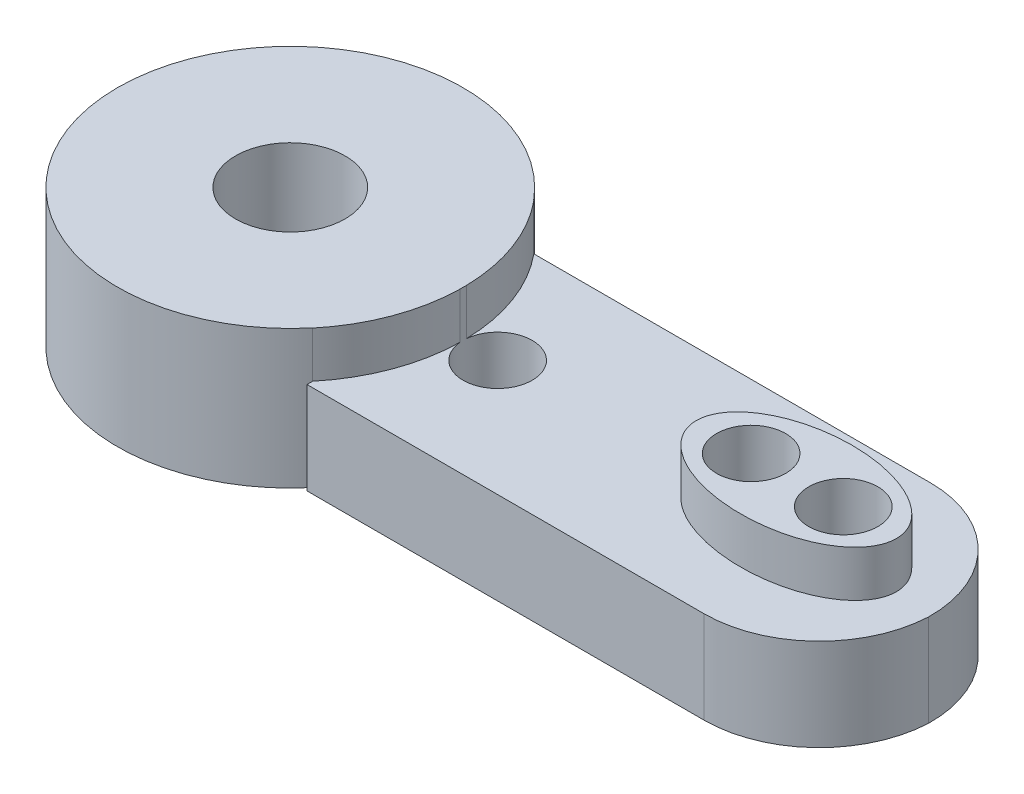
ISO-10303-21;
HEADER;
FILE_DESCRIPTION(('STEP AP214'),'2;1');
FILE_NAME('part.step','',(''),(''),'','','');
FILE_SCHEMA(('AUTOMOTIVE_DESIGN { 1 0 10303 214 1 1 1 1 }'));
ENDSEC;
DATA;
#1=APPLICATION_CONTEXT('core data for automotive mechanical design processes');
#2=APPLICATION_PROTOCOL_DEFINITION('international standard','automotive_design',2000,#1);
#3=PRODUCT_CONTEXT('',#1,'mechanical');
#4=PRODUCT('Part','Part','',(#3));
#5=PRODUCT_RELATED_PRODUCT_CATEGORY('part','',(#4));
#6=PRODUCT_DEFINITION_FORMATION('','',#4);
#7=PRODUCT_DEFINITION_CONTEXT('part definition',#1,'design');
#8=PRODUCT_DEFINITION('design','',#6,#7);
#9=PRODUCT_DEFINITION_SHAPE('','',#8);
#10=(LENGTH_UNIT() NAMED_UNIT(*) SI_UNIT(.MILLI.,.METRE.));
#11=(NAMED_UNIT(*) PLANE_ANGLE_UNIT() SI_UNIT($,.RADIAN.));
#12=(NAMED_UNIT(*) SI_UNIT($,.STERADIAN.) SOLID_ANGLE_UNIT());
#13=UNCERTAINTY_MEASURE_WITH_UNIT(LENGTH_MEASURE(1.E-05),#10,'distance_accuracy_value','');
#14=(GEOMETRIC_REPRESENTATION_CONTEXT(3) GLOBAL_UNCERTAINTY_ASSIGNED_CONTEXT((#13)) GLOBAL_UNIT_ASSIGNED_CONTEXT((#10,
#11,#12)) REPRESENTATION_CONTEXT('',''));
#15=CARTESIAN_POINT('',(0.,0.,0.));
#16=DIRECTION('',(0.,0.,1.));
#17=DIRECTION('',(1.,0.,0.));
#18=AXIS2_PLACEMENT_3D('',#15,#16,#17);
#19=CARTESIAN_POINT('',(-12.0179381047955,6.,-0.605555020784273));
#20=DIRECTION('',(0.,1.,0.));
#21=DIRECTION('',(0.,0.,1.));
#22=AXIS2_PLACEMENT_3D('',#19,#20,#21);
#23=PLANE('',#22);
#24=CARTESIAN_POINT('',(-12.0179381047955,6.,-0.605555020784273));
#25=DIRECTION('',(0.,1.,0.));
#26=DIRECTION('',(0.,0.,1.));
#27=AXIS2_PLACEMENT_3D('',#24,#25,#26);
#28=CIRCLE('',#27,2.37554244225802);
#29=CARTESIAN_POINT('',(-12.0179381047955,6.,1.76998742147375));
#30=VERTEX_POINT('',#29);
#31=EDGE_CURVE('E149',#30,#30,#28,.T.);
#32=ORIENTED_EDGE('',*,*,#31,.F.);
#33=EDGE_LOOP('',(#32));
#34=FACE_BOUND('',#33,.T.);
#35=DIRECTION('',(0.,0.,1.));
#36=VECTOR('',#35,1.);
#37=CARTESIAN_POINT('',(-6.24526724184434,6.,4.18258356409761));
#38=LINE('',#37,#36);
#39=CARTESIAN_POINT('',(-6.24526724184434,6.,4.18258356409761));
#40=VERTEX_POINT('',#39);
#41=CARTESIAN_POINT('',(-6.24526724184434,6.,4.19456089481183));
#42=VERTEX_POINT('',#41);
#43=EDGE_CURVE('E128',#40,#42,#38,.T.);
#44=ORIENTED_EDGE('',*,*,#43,.T.);
#45=CARTESIAN_POINT('',(-12.0179381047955,6.,-0.605555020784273));
#46=DIRECTION('',(0.,1.,0.));
#47=DIRECTION('',(0.,0.,1.));
#48=AXIS2_PLACEMENT_3D('',#45,#46,#47);
#49=CIRCLE('',#48,7.50765220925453);
#50=CARTESIAN_POINT('',(-4.51155801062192,6.,-0.467353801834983));
#51=VERTEX_POINT('',#50);
#52=EDGE_CURVE('E110',#42,#51,#49,.T.);
#53=ORIENTED_EDGE('',*,*,#52,.T.);
#54=CARTESIAN_POINT('',(-3.0179381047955,6.,-0.605555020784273));
#55=DIRECTION('',(0.,1.,0.));
#56=DIRECTION('',(0.,0.,1.));
#57=AXIS2_PLACEMENT_3D('',#54,#55,#56);
#58=CIRCLE('',#57,1.5);
#59=CARTESIAN_POINT('',(-4.51155801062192,6.,-0.743756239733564));
#60=VERTEX_POINT('',#59);
#61=EDGE_CURVE('E178',#60,#51,#58,.T.);
#62=ORIENTED_EDGE('',*,*,#61,.F.);
#63=CARTESIAN_POINT('',(-6.23532878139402,6.,-5.39369360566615));
#64=VERTEX_POINT('',#63);
#65=EDGE_CURVE('E122',#60,#64,#49,.T.);
#66=ORIENTED_EDGE('',*,*,#65,.T.);
#67=DIRECTION('',(-1.,0.,0.));
#68=VECTOR('',#67,1.);
#69=CARTESIAN_POINT('',(-6.24526724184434,6.,-5.39369360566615));
#70=LINE('',#69,#68);
#71=CARTESIAN_POINT('',(-6.24526724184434,6.,-5.39369360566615));
#72=VERTEX_POINT('',#71);
#73=EDGE_CURVE('E137',#64,#72,#70,.T.);
#74=ORIENTED_EDGE('',*,*,#73,.T.);
#75=CARTESIAN_POINT('',(-12.0179381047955,6.,-0.605555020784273));
#76=DIRECTION('',(0.,1.,0.));
#77=DIRECTION('',(0.,0.,1.));
#78=AXIS2_PLACEMENT_3D('',#75,#76,#77);
#79=CIRCLE('',#78,7.5);
#80=EDGE_CURVE('E135',#72,#40,#79,.T.);
#81=ORIENTED_EDGE('',*,*,#80,.T.);
#82=EDGE_LOOP('',(#44,#53,#62,#66,#74,#81));
#83=FACE_BOUND('',#82,.T.);
#84=ADVANCED_FACE('F33',(#34,#83),#23,.T.);
#85=CARTESIAN_POINT('',(11.9820618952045,6.,-0.605555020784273));
#86=DIRECTION('',(0.,1.,0.));
#87=DIRECTION('',(0.,0.,1.));
#88=AXIS2_PLACEMENT_3D('',#85,#86,#87);
#89=CIRCLE('',#88,1.5);
#90=CARTESIAN_POINT('',(11.9820618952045,6.,0.894444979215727));
#91=VERTEX_POINT('',#90);
#92=EDGE_CURVE('E248',#91,#91,#89,.T.);
#93=ORIENTED_EDGE('',*,*,#92,.F.);
#94=EDGE_LOOP('',(#93));
#95=FACE_BOUND('',#94,.T.);
#96=CARTESIAN_POINT('',(7.9820618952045,6.,-0.605555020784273));
#97=DIRECTION('',(0.,1.,0.));
#98=DIRECTION('',(0.,0.,1.));
#99=AXIS2_PLACEMENT_3D('',#96,#97,#98);
#100=CIRCLE('',#99,1.5);
#101=CARTESIAN_POINT('',(7.9820618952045,6.,0.894444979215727));
#102=VERTEX_POINT('',#101);
#103=EDGE_CURVE('E185',#102,#102,#100,.T.);
#104=ORIENTED_EDGE('',*,*,#103,.F.);
#105=EDGE_LOOP('',(#104));
#106=FACE_BOUND('',#105,.T.);
#107=CARTESIAN_POINT('',(9.9442776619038,6.,-0.605555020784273));
#108=DIRECTION('',(0.,1.,0.));
#109=DIRECTION('',(0.999883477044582,0.,0.0152653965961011));
#110=AXIS2_PLACEMENT_3D('',#107,#108,#109);
#111=ELLIPSE('',#110,4.38841520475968,2.49977994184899);
#112=CARTESIAN_POINT('',(14.3321815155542,6.,-0.538564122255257));
#113=VERTEX_POINT('',#112);
#114=EDGE_CURVE('E335',#113,#113,#111,.T.);
#115=ORIENTED_EDGE('',*,*,#114,.T.);
#116=EDGE_LOOP('',(#115));
#117=FACE_BOUND('',#116,.T.);
#118=ADVANCED_FACE('F198',(#95,#106,#117),#23,.T.);
#119=CARTESIAN_POINT('',(-6.24526724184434,6.,4.18258356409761));
#120=DIRECTION('',(1.,0.,0.));
#121=DIRECTION('',(0.,0.,-1.));
#122=AXIS2_PLACEMENT_3D('',#119,#120,#121);
#123=PLANE('',#122);
#124=DIRECTION('',(0.,0.,1.));
#125=VECTOR('',#124,1.);
#126=CARTESIAN_POINT('',(-6.24526724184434,4.,4.18258356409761));
#127=LINE('',#126,#125);
#128=CARTESIAN_POINT('',(-6.24526724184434,4.,4.19456089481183));
#129=VERTEX_POINT('',#128);
#130=CARTESIAN_POINT('',(-6.24526724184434,4.,4.44013902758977));
#131=VERTEX_POINT('',#130);
#132=EDGE_CURVE('E131',#129,#131,#127,.T.);
#133=ORIENTED_EDGE('',*,*,#132,.F.);
#134=DIRECTION('',(0.,1.,0.));
#135=VECTOR('',#134,1.);
#136=CARTESIAN_POINT('',(-6.24526724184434,4.,4.19456089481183));
#137=LINE('',#136,#135);
#138=EDGE_CURVE('E114',#42,#129,#137,.F.);
#139=ORIENTED_EDGE('',*,*,#138,.F.);
#140=ORIENTED_EDGE('',*,*,#43,.F.);
#141=DIRECTION('',(0.,-1.,0.));
#142=VECTOR('',#141,1.);
#143=CARTESIAN_POINT('',(-6.24526724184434,6.,4.18258356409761));
#144=LINE('',#143,#142);
#145=CARTESIAN_POINT('',(-6.24526724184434,0.,4.18258356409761));
#146=VERTEX_POINT('',#145);
#147=EDGE_CURVE('E160',#40,#146,#144,.T.);
#148=ORIENTED_EDGE('',*,*,#147,.T.);
#149=DIRECTION('',(0.,0.,1.));
#150=VECTOR('',#149,1.);
#151=CARTESIAN_POINT('',(-6.24526724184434,0.,4.18258356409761));
#152=LINE('',#151,#150);
#153=CARTESIAN_POINT('',(-6.24526724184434,0.,4.44013902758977));
#154=VERTEX_POINT('',#153);
#155=EDGE_CURVE('E148',#146,#154,#152,.T.);
#156=ORIENTED_EDGE('',*,*,#155,.T.);
#157=DIRECTION('',(0.,-1.,0.));
#158=VECTOR('',#157,1.);
#159=CARTESIAN_POINT('',(-6.24526724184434,6.,4.44013902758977));
#160=LINE('',#159,#158);
#161=EDGE_CURVE('E158',#131,#154,#160,.T.);
#162=ORIENTED_EDGE('',*,*,#161,.F.);
#163=EDGE_LOOP('',(#133,#139,#140,#148,#156,#162));
#164=FACE_BOUND('',#163,.T.);
#165=ADVANCED_FACE('F126',(#164),#123,.F.);
#166=CARTESIAN_POINT('',(-6.24526724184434,6.,4.44013902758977));
#167=DIRECTION('',(0.,0.,-1.));
#168=DIRECTION('',(-1.,0.,0.));
#169=AXIS2_PLACEMENT_3D('',#166,#167,#168);
#170=PLANE('',#169);
#171=DIRECTION('',(1.,0.,0.));
#172=VECTOR('',#171,1.);
#173=CARTESIAN_POINT('',(-6.24526724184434,4.,4.44013902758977));
#174=LINE('',#173,#172);
#175=CARTESIAN_POINT('',(10.9817881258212,4.,4.44013902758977));
#176=VERTEX_POINT('',#175);
#177=EDGE_CURVE('E239',#131,#176,#174,.T.);
#178=ORIENTED_EDGE('',*,*,#177,.F.);
#179=ORIENTED_EDGE('',*,*,#161,.T.);
#180=DIRECTION('',(1.,0.,0.));
#181=VECTOR('',#180,1.);
#182=CARTESIAN_POINT('',(-6.24526724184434,0.,4.44013902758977));
#183=LINE('',#182,#181);
#184=CARTESIAN_POINT('',(10.9817881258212,0.,4.44013902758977));
#185=VERTEX_POINT('',#184);
#186=EDGE_CURVE('E152',#154,#185,#183,.T.);
#187=ORIENTED_EDGE('',*,*,#186,.T.);
#188=DIRECTION('',(0.,-1.,0.));
#189=VECTOR('',#188,1.);
#190=CARTESIAN_POINT('',(10.9817881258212,6.,4.44013902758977));
#191=LINE('',#190,#189);
#192=EDGE_CURVE('E168',#185,#176,#191,.F.);
#193=ORIENTED_EDGE('',*,*,#192,.T.);
#194=EDGE_LOOP('',(#178,#179,#187,#193));
#195=FACE_BOUND('',#194,.T.);
#196=ADVANCED_FACE('F216',(#195),#170,.F.);
#197=CARTESIAN_POINT('',(-6.24526724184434,6.,-5.39369360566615));
#198=DIRECTION('',(0.,0.,1.));
#199=DIRECTION('',(1.,0.,0.));
#200=AXIS2_PLACEMENT_3D('',#197,#198,#199);
#201=PLANE('',#200);
#202=DIRECTION('',(-1.,0.,0.));
#203=VECTOR('',#202,1.);
#204=CARTESIAN_POINT('',(-6.24526724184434,4.,-5.39369360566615));
#205=LINE('',#204,#203);
#206=CARTESIAN_POINT('',(10.9761722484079,4.,-5.39369360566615));
#207=VERTEX_POINT('',#206);
#208=CARTESIAN_POINT('',(-6.23532878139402,4.,-5.39369360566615));
#209=VERTEX_POINT('',#208);
#210=EDGE_CURVE('E235',#207,#209,#205,.T.);
#211=ORIENTED_EDGE('',*,*,#210,.F.);
#212=DIRECTION('',(0.,-1.,0.));
#213=VECTOR('',#212,1.);
#214=CARTESIAN_POINT('',(10.9761722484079,6.,-5.39369360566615));
#215=LINE('',#214,#213);
#216=CARTESIAN_POINT('',(10.9761722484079,0.,-5.39369360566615));
#217=VERTEX_POINT('',#216);
#218=EDGE_CURVE('E162',#207,#217,#215,.T.);
#219=ORIENTED_EDGE('',*,*,#218,.T.);
#220=DIRECTION('',(-1.,0.,0.));
#221=VECTOR('',#220,1.);
#222=CARTESIAN_POINT('',(-6.24526724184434,0.,-5.39369360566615));
#223=LINE('',#222,#221);
#224=CARTESIAN_POINT('',(-6.24526724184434,0.,-5.39369360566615));
#225=VERTEX_POINT('',#224);
#226=EDGE_CURVE('E141',#217,#225,#223,.T.);
#227=ORIENTED_EDGE('',*,*,#226,.T.);
#228=DIRECTION('',(0.,-1.,0.));
#229=VECTOR('',#228,1.);
#230=CARTESIAN_POINT('',(-6.24526724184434,6.,-5.39369360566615));
#231=LINE('',#230,#229);
#232=EDGE_CURVE('E139',#72,#225,#231,.T.);
#233=ORIENTED_EDGE('',*,*,#232,.F.);
#234=ORIENTED_EDGE('',*,*,#73,.F.);
#235=DIRECTION('',(0.,1.,0.));
#236=VECTOR('',#235,1.);
#237=CARTESIAN_POINT('',(-6.23532878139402,4.,-5.39369360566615));
#238=LINE('',#237,#236);
#239=EDGE_CURVE('E132',#209,#64,#238,.T.);
#240=ORIENTED_EDGE('',*,*,#239,.F.);
#241=EDGE_LOOP('',(#211,#219,#227,#233,#234,#240));
#242=FACE_BOUND('',#241,.T.);
#243=ADVANCED_FACE('F213',(#242),#201,.F.);
#244=CARTESIAN_POINT('',(-3.0179381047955,6.,-0.605555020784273));
#245=DIRECTION('',(0.,-1.,0.));
#246=DIRECTION('',(0.,0.,-1.));
#247=AXIS2_PLACEMENT_3D('',#244,#245,#246);
#248=CYLINDRICAL_SURFACE('',#247,1.5);
#249=CARTESIAN_POINT('',(-3.0179381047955,0.,-0.605555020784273));
#250=DIRECTION('',(0.,1.,0.));
#251=DIRECTION('',(0.,0.,1.));
#252=AXIS2_PLACEMENT_3D('',#249,#250,#251);
#253=CIRCLE('',#252,1.5);
#254=CARTESIAN_POINT('',(-3.0179381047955,0.,0.894444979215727));
#255=VERTEX_POINT('',#254);
#256=EDGE_CURVE('E181',#255,#255,#253,.T.);
#257=ORIENTED_EDGE('',*,*,#256,.F.);
#258=EDGE_LOOP('',(#257));
#259=FACE_BOUND('',#258,.T.);
#260=CARTESIAN_POINT('',(-3.0179381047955,4.,-0.605555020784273));
#261=DIRECTION('',(0.,1.,0.));
#262=DIRECTION('',(0.,0.,1.));
#263=AXIS2_PLACEMENT_3D('',#260,#261,#262);
#264=CIRCLE('',#263,1.5);
#265=CARTESIAN_POINT('',(-4.51155801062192,4.,-0.467353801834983));
#266=VERTEX_POINT('',#265);
#267=CARTESIAN_POINT('',(-4.51155801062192,4.,-0.743756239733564));
#268=VERTEX_POINT('',#267);
#269=EDGE_CURVE('E177',#266,#268,#264,.T.);
#270=ORIENTED_EDGE('',*,*,#269,.T.);
#271=DIRECTION('',(0.,1.,0.));
#272=VECTOR('',#271,1.);
#273=CARTESIAN_POINT('',(-4.51155801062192,5.,-0.743756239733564));
#274=LINE('',#273,#272);
#275=EDGE_CURVE('E11',#268,#60,#274,.T.);
#276=ORIENTED_EDGE('',*,*,#275,.T.);
#277=ORIENTED_EDGE('',*,*,#61,.T.);
#278=DIRECTION('',(0.,1.,0.));
#279=VECTOR('',#278,1.);
#280=CARTESIAN_POINT('',(-4.51155801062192,5.,-0.467353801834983));
#281=LINE('',#280,#279);
#282=EDGE_CURVE('E41',#51,#266,#281,.F.);
#283=ORIENTED_EDGE('',*,*,#282,.T.);
#284=EDGE_LOOP('',(#270,#276,#277,#283));
#285=FACE_BOUND('',#284,.T.);
#286=ADVANCED_FACE('F176',(#259,#285),#248,.F.);
#287=CARTESIAN_POINT('',(10.9817881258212,6.,-0.559860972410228));
#288=DIRECTION('',(0.,-1.,0.));
#289=DIRECTION('',(0.,0.,-1.));
#290=AXIS2_PLACEMENT_3D('',#287,#288,#289);
#291=CYLINDRICAL_SURFACE('',#290,5.);
#292=DIRECTION('',(0.,-1.,0.));
#293=VECTOR('',#292,1.);
#294=CARTESIAN_POINT('',(15.9754363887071,3.,-0.307914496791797));
#295=LINE('',#294,#293);
#296=CARTESIAN_POINT('',(15.9754363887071,4.,-0.307914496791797));
#297=VERTEX_POINT('',#296);
#298=CARTESIAN_POINT('',(15.9754363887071,0.,-0.307914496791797));
#299=VERTEX_POINT('',#298);
#300=EDGE_CURVE('E55',#297,#299,#295,.T.);
#301=ORIENTED_EDGE('',*,*,#300,.F.);
#302=CARTESIAN_POINT('',(10.9817881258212,4.,-0.559860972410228));
#303=DIRECTION('',(0.,1.,0.));
#304=DIRECTION('',(0.,0.,1.));
#305=AXIS2_PLACEMENT_3D('',#302,#303,#304);
#306=CIRCLE('',#305,5.);
#307=EDGE_CURVE('E48',#297,#176,#306,.F.);
#308=ORIENTED_EDGE('',*,*,#307,.T.);
#309=ORIENTED_EDGE('',*,*,#192,.F.);
#310=CARTESIAN_POINT('',(10.9817881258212,0.,-0.559860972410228));
#311=DIRECTION('',(0.,1.,0.));
#312=DIRECTION('',(0.,0.,1.));
#313=AXIS2_PLACEMENT_3D('',#310,#311,#312);
#314=CIRCLE('',#313,5.);
#315=EDGE_CURVE('E164',#299,#185,#314,.F.);
#316=ORIENTED_EDGE('',*,*,#315,.F.);
#317=EDGE_LOOP('',(#301,#308,#309,#316));
#318=FACE_BOUND('',#317,.T.);
#319=ADVANCED_FACE('F35',(#318),#291,.T.);
#320=CARTESIAN_POINT('',(10.9761722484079,6.,-0.393693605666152));
#321=DIRECTION('',(0.,-1.,0.));
#322=DIRECTION('',(0.,0.,-1.));
#323=AXIS2_PLACEMENT_3D('',#320,#321,#322);
#324=CYLINDRICAL_SURFACE('',#323,5.);
#325=ORIENTED_EDGE('',*,*,#218,.F.);
#326=CARTESIAN_POINT('',(10.9761722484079,4.,-0.393693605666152));
#327=DIRECTION('',(0.,1.,0.));
#328=DIRECTION('',(0.,0.,1.));
#329=AXIS2_PLACEMENT_3D('',#326,#327,#328);
#330=CIRCLE('',#329,5.);
#331=EDGE_CURVE('E171',#207,#297,#330,.F.);
#332=ORIENTED_EDGE('',*,*,#331,.T.);
#333=ORIENTED_EDGE('',*,*,#300,.T.);
#334=CARTESIAN_POINT('',(10.9761722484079,0.,-0.393693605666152));
#335=DIRECTION('',(0.,1.,0.));
#336=DIRECTION('',(0.,0.,1.));
#337=AXIS2_PLACEMENT_3D('',#334,#335,#336);
#338=CIRCLE('',#337,5.);
#339=EDGE_CURVE('E166',#217,#299,#338,.F.);
#340=ORIENTED_EDGE('',*,*,#339,.F.);
#341=EDGE_LOOP('',(#325,#332,#333,#340));
#342=FACE_BOUND('',#341,.T.);
#343=ADVANCED_FACE('F211',(#342),#324,.T.);
#344=CARTESIAN_POINT('',(-12.0179381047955,0.,-0.605555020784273));
#345=DIRECTION('',(0.,1.,0.));
#346=DIRECTION('',(0.,0.,1.));
#347=AXIS2_PLACEMENT_3D('',#344,#345,#346);
#348=PLANE('',#347);
#349=ORIENTED_EDGE('',*,*,#226,.F.);
#350=ORIENTED_EDGE('',*,*,#339,.T.);
#351=ORIENTED_EDGE('',*,*,#315,.T.);
#352=ORIENTED_EDGE('',*,*,#186,.F.);
#353=ORIENTED_EDGE('',*,*,#155,.F.);
#354=CARTESIAN_POINT('',(-12.0179381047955,0.,-0.605555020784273));
#355=DIRECTION('',(0.,1.,0.));
#356=DIRECTION('',(0.,0.,1.));
#357=AXIS2_PLACEMENT_3D('',#354,#355,#356);
#358=CIRCLE('',#357,7.5);
#359=EDGE_CURVE('E145',#225,#146,#358,.T.);
#360=ORIENTED_EDGE('',*,*,#359,.F.);
#361=EDGE_LOOP('',(#349,#350,#351,#352,#353,#360));
#362=FACE_BOUND('',#361,.T.);
#363=CARTESIAN_POINT('',(-12.0179381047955,0.,-0.605555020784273));
#364=DIRECTION('',(0.,1.,0.));
#365=DIRECTION('',(0.,0.,1.));
#366=AXIS2_PLACEMENT_3D('',#363,#364,#365);
#367=CIRCLE('',#366,2.37554244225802);
#368=CARTESIAN_POINT('',(-12.0179381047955,0.,1.76998742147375));
#369=VERTEX_POINT('',#368);
#370=EDGE_CURVE('E180',#369,#369,#367,.T.);
#371=ORIENTED_EDGE('',*,*,#370,.T.);
#372=EDGE_LOOP('',(#371));
#373=FACE_BOUND('',#372,.T.);
#374=ORIENTED_EDGE('',*,*,#256,.T.);
#375=EDGE_LOOP('',(#374));
#376=FACE_BOUND('',#375,.T.);
#377=CARTESIAN_POINT('',(7.9820618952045,0.,-0.605555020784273));
#378=DIRECTION('',(0.,1.,0.));
#379=DIRECTION('',(0.,0.,1.));
#380=AXIS2_PLACEMENT_3D('',#377,#378,#379);
#381=CIRCLE('',#380,1.5);
#382=CARTESIAN_POINT('',(7.9820618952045,0.,0.894444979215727));
#383=VERTEX_POINT('',#382);
#384=EDGE_CURVE('E188',#383,#383,#381,.T.);
#385=ORIENTED_EDGE('',*,*,#384,.T.);
#386=EDGE_LOOP('',(#385));
#387=FACE_BOUND('',#386,.T.);
#388=CARTESIAN_POINT('',(11.9820618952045,0.,-0.605555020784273));
#389=DIRECTION('',(0.,1.,0.));
#390=DIRECTION('',(0.,0.,1.));
#391=AXIS2_PLACEMENT_3D('',#388,#389,#390);
#392=CIRCLE('',#391,1.5);
#393=CARTESIAN_POINT('',(11.9820618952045,0.,0.894444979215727));
#394=VERTEX_POINT('',#393);
#395=EDGE_CURVE('E173',#394,#394,#392,.T.);
#396=ORIENTED_EDGE('',*,*,#395,.T.);
#397=EDGE_LOOP('',(#396));
#398=FACE_BOUND('',#397,.T.);
#399=ADVANCED_FACE('F207',(#362,#373,#376,#387,#398),#348,.F.);
#400=CARTESIAN_POINT('',(-12.0179381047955,6.,-0.605555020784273));
#401=DIRECTION('',(0.,-1.,0.));
#402=DIRECTION('',(0.,0.,-1.));
#403=AXIS2_PLACEMENT_3D('',#400,#401,#402);
#404=CYLINDRICAL_SURFACE('',#403,7.5);
#405=ORIENTED_EDGE('',*,*,#359,.T.);
#406=ORIENTED_EDGE('',*,*,#147,.F.);
#407=ORIENTED_EDGE('',*,*,#80,.F.);
#408=ORIENTED_EDGE('',*,*,#232,.T.);
#409=EDGE_LOOP('',(#405,#406,#407,#408));
#410=FACE_BOUND('',#409,.T.);
#411=ADVANCED_FACE('F210',(#410),#404,.T.);
#412=CARTESIAN_POINT('',(-12.0179381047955,6.,-0.605555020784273));
#413=DIRECTION('',(0.,-1.,0.));
#414=DIRECTION('',(0.,0.,-1.));
#415=AXIS2_PLACEMENT_3D('',#412,#413,#414);
#416=CYLINDRICAL_SURFACE('',#415,2.37554244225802);
#417=ORIENTED_EDGE('',*,*,#31,.T.);
#418=EDGE_LOOP('',(#417));
#419=FACE_BOUND('',#418,.T.);
#420=ORIENTED_EDGE('',*,*,#370,.F.);
#421=EDGE_LOOP('',(#420));
#422=FACE_BOUND('',#421,.T.);
#423=ADVANCED_FACE('F194',(#419,#422),#416,.F.);
#424=CARTESIAN_POINT('',(7.9820618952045,6.,-0.605555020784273));
#425=DIRECTION('',(0.,-1.,0.));
#426=DIRECTION('',(0.,0.,-1.));
#427=AXIS2_PLACEMENT_3D('',#424,#425,#426);
#428=CYLINDRICAL_SURFACE('',#427,1.5);
#429=ORIENTED_EDGE('',*,*,#103,.T.);
#430=EDGE_LOOP('',(#429));
#431=FACE_BOUND('',#430,.T.);
#432=ORIENTED_EDGE('',*,*,#384,.F.);
#433=EDGE_LOOP('',(#432));
#434=FACE_BOUND('',#433,.T.);
#435=ADVANCED_FACE('F260',(#431,#434),#428,.F.);
#436=CARTESIAN_POINT('',(11.9820618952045,6.,-0.605555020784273));
#437=DIRECTION('',(0.,-1.,0.));
#438=DIRECTION('',(0.,0.,-1.));
#439=AXIS2_PLACEMENT_3D('',#436,#437,#438);
#440=CYLINDRICAL_SURFACE('',#439,1.5);
#441=ORIENTED_EDGE('',*,*,#92,.T.);
#442=EDGE_LOOP('',(#441));
#443=FACE_BOUND('',#442,.T.);
#444=ORIENTED_EDGE('',*,*,#395,.F.);
#445=EDGE_LOOP('',(#444));
#446=FACE_BOUND('',#445,.T.);
#447=ADVANCED_FACE('F262',(#443,#446),#440,.F.);
#448=CARTESIAN_POINT('',(-12.0179381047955,4.,-0.605555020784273));
#449=DIRECTION('',(0.,1.,0.));
#450=DIRECTION('',(0.,0.,1.));
#451=AXIS2_PLACEMENT_3D('',#448,#449,#450);
#452=CYLINDRICAL_SURFACE('',#451,7.50765220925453);
#453=ORIENTED_EDGE('',*,*,#138,.T.);
#454=CARTESIAN_POINT('',(-12.0179381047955,4.,-0.605555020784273));
#455=DIRECTION('',(0.,1.,0.));
#456=DIRECTION('',(0.,0.,1.));
#457=AXIS2_PLACEMENT_3D('',#454,#455,#456);
#458=CIRCLE('',#457,7.50765220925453);
#459=EDGE_CURVE('E242',#129,#266,#458,.T.);
#460=ORIENTED_EDGE('',*,*,#459,.T.);
#461=ORIENTED_EDGE('',*,*,#282,.F.);
#462=ORIENTED_EDGE('',*,*,#52,.F.);
#463=EDGE_LOOP('',(#453,#460,#461,#462));
#464=FACE_BOUND('',#463,.T.);
#465=ADVANCED_FACE('F112',(#464),#452,.T.);
#466=ORIENTED_EDGE('',*,*,#239,.T.);
#467=ORIENTED_EDGE('',*,*,#65,.F.);
#468=ORIENTED_EDGE('',*,*,#275,.F.);
#469=EDGE_CURVE('E121',#268,#209,#458,.T.);
#470=ORIENTED_EDGE('',*,*,#469,.T.);
#471=EDGE_LOOP('',(#466,#467,#468,#470));
#472=FACE_BOUND('',#471,.T.);
#473=ADVANCED_FACE('F297',(#472),#452,.T.);
#474=CARTESIAN_POINT('',(0.,4.,0.));
#475=DIRECTION('',(0.,1.,0.));
#476=DIRECTION('',(0.,0.,1.));
#477=AXIS2_PLACEMENT_3D('',#474,#475,#476);
#478=PLANE('',#477);
#479=CARTESIAN_POINT('',(9.9442776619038,4.,-0.605555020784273));
#480=DIRECTION('',(0.,1.,0.));
#481=DIRECTION('',(0.999883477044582,0.,0.0152653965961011));
#482=AXIS2_PLACEMENT_3D('',#479,#480,#481);
#483=ELLIPSE('',#482,4.38841520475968,2.49977994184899);
#484=CARTESIAN_POINT('',(14.3321815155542,4.,-0.538564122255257));
#485=VERTEX_POINT('',#484);
#486=EDGE_CURVE('E332',#485,#485,#483,.T.);
#487=ORIENTED_EDGE('',*,*,#486,.F.);
#488=EDGE_LOOP('',(#487));
#489=FACE_BOUND('',#488,.T.);
#490=ORIENTED_EDGE('',*,*,#459,.F.);
#491=ORIENTED_EDGE('',*,*,#132,.T.);
#492=ORIENTED_EDGE('',*,*,#177,.T.);
#493=ORIENTED_EDGE('',*,*,#307,.F.);
#494=ORIENTED_EDGE('',*,*,#331,.F.);
#495=ORIENTED_EDGE('',*,*,#210,.T.);
#496=ORIENTED_EDGE('',*,*,#469,.F.);
#497=ORIENTED_EDGE('',*,*,#269,.F.);
#498=EDGE_LOOP('',(#490,#491,#492,#493,#494,#495,#496,#497));
#499=FACE_BOUND('',#498,.T.);
#500=ADVANCED_FACE('F307',(#489,#499),#478,.T.);
#501=DIRECTION('',(0.,1.,0.));
#502=VECTOR('',#501,1.);
#503=SURFACE_OF_LINEAR_EXTRUSION('',#483,#502);
#504=ORIENTED_EDGE('',*,*,#486,.T.);
#505=EDGE_LOOP('',(#504));
#506=FACE_BOUND('',#505,.T.);
#507=ORIENTED_EDGE('',*,*,#114,.F.);
#508=EDGE_LOOP('',(#507));
#509=FACE_BOUND('',#508,.T.);
#510=ADVANCED_FACE('F316',(#506,#509),#503,.T.);
#511=CLOSED_SHELL('',(#84,#118,#165,#196,#243,#286,#319,#343,#399,#411,#423,#435,#447,#465,#473,
#500,#510));
#512=MANIFOLD_SOLID_BREP('B2',#511);
#513=ADVANCED_BREP_SHAPE_REPRESENTATION('',(#18,#512),#14);
#514=SHAPE_DEFINITION_REPRESENTATION(#9,#513);
ENDSEC;
END-ISO-10303-21;
